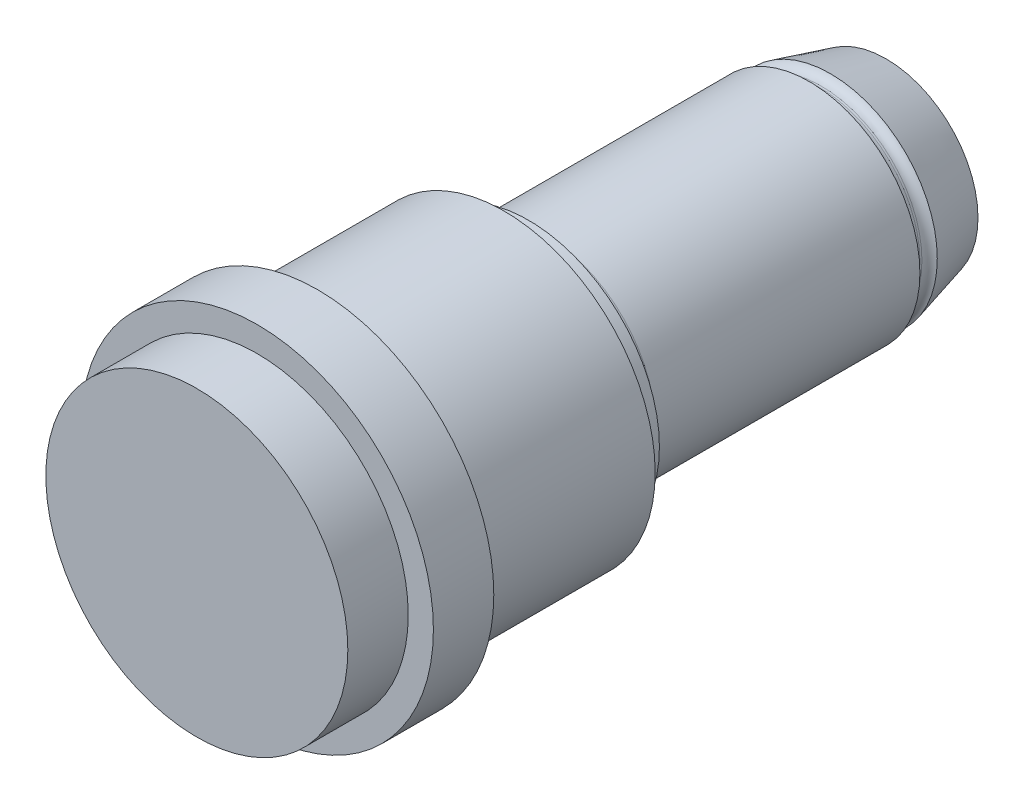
ISO-10303-21;
HEADER;
FILE_DESCRIPTION(('STEP AP214'),'2;1');
FILE_NAME('part.step','',(''),(''),'','','');
FILE_SCHEMA(('AUTOMOTIVE_DESIGN { 1 0 10303 214 1 1 1 1 }'));
ENDSEC;
DATA;
#1=APPLICATION_CONTEXT('core data for automotive mechanical design processes');
#2=APPLICATION_PROTOCOL_DEFINITION('international standard','automotive_design',2000,#1);
#3=PRODUCT_CONTEXT('',#1,'mechanical');
#4=PRODUCT('Part','Part','',(#3));
#5=PRODUCT_RELATED_PRODUCT_CATEGORY('part','',(#4));
#6=PRODUCT_DEFINITION_FORMATION('','',#4);
#7=PRODUCT_DEFINITION_CONTEXT('part definition',#1,'design');
#8=PRODUCT_DEFINITION('design','',#6,#7);
#9=PRODUCT_DEFINITION_SHAPE('','',#8);
#10=(LENGTH_UNIT() NAMED_UNIT(*) SI_UNIT(.MILLI.,.METRE.));
#11=(NAMED_UNIT(*) PLANE_ANGLE_UNIT() SI_UNIT($,.RADIAN.));
#12=(NAMED_UNIT(*) SI_UNIT($,.STERADIAN.) SOLID_ANGLE_UNIT());
#13=UNCERTAINTY_MEASURE_WITH_UNIT(LENGTH_MEASURE(1.E-05),#10,'distance_accuracy_value','');
#14=(GEOMETRIC_REPRESENTATION_CONTEXT(3) GLOBAL_UNCERTAINTY_ASSIGNED_CONTEXT((#13)) GLOBAL_UNIT_ASSIGNED_CONTEXT((#10,
#11,#12)) REPRESENTATION_CONTEXT('',''));
#15=CARTESIAN_POINT('',(0.,0.,0.));
#16=DIRECTION('',(0.,0.,1.));
#17=DIRECTION('',(1.,0.,0.));
#18=AXIS2_PLACEMENT_3D('',#15,#16,#17);
#19=CARTESIAN_POINT('',(170.,124.,-20.33));
#20=DIRECTION('',(0.,0.,1.));
#21=DIRECTION('',(1.,0.,0.));
#22=AXIS2_PLACEMENT_3D('',#19,#20,#21);
#23=TOROIDAL_SURFACE('',#22,11.,1.);
#24=CARTESIAN_POINT('',(170.,124.,-20.33));
#25=DIRECTION('',(0.,0.,1.));
#26=DIRECTION('',(1.,0.,0.));
#27=AXIS2_PLACEMENT_3D('',#24,#25,#26);
#28=CIRCLE('',#27,10.);
#29=CARTESIAN_POINT('',(180.,124.,-20.33));
#30=VERTEX_POINT('',#29);
#31=EDGE_CURVE('E50',#30,#30,#28,.T.);
#32=ORIENTED_EDGE('',*,*,#31,.F.);
#33=EDGE_LOOP('',(#32));
#34=FACE_BOUND('',#33,.T.);
#35=CARTESIAN_POINT('',(170.,124.,-21.2487202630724));
#36=DIRECTION('',(0.,0.,1.));
#37=DIRECTION('',(1.,0.,0.));
#38=AXIS2_PLACEMENT_3D('',#35,#36,#37);
#39=CIRCLE('',#38,10.6050910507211);
#40=CARTESIAN_POINT('',(180.605091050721,124.,-21.2487202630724));
#41=VERTEX_POINT('',#40);
#42=EDGE_CURVE('E10',#41,#41,#39,.T.);
#43=ORIENTED_EDGE('',*,*,#42,.T.);
#44=EDGE_LOOP('',(#43));
#45=FACE_BOUND('',#44,.T.);
#46=ADVANCED_FACE('F14',(#34,#45),#23,.F.);
#47=CARTESIAN_POINT('',(170.,124.,41.7));
#48=DIRECTION('',(0.,0.,-1.));
#49=DIRECTION('',(-1.,0.,0.));
#50=AXIS2_PLACEMENT_3D('',#47,#48,#49);
#51=CYLINDRICAL_SURFACE('',#50,15.);
#52=CARTESIAN_POINT('',(170.,124.,41.7));
#53=DIRECTION('',(0.,0.,1.));
#54=DIRECTION('',(1.,0.,0.));
#55=AXIS2_PLACEMENT_3D('',#52,#53,#54);
#56=CIRCLE('',#55,15.);
#57=CARTESIAN_POINT('',(185.,124.,41.7));
#58=VERTEX_POINT('',#57);
#59=EDGE_CURVE('E25',#58,#58,#56,.T.);
#60=ORIENTED_EDGE('',*,*,#59,.F.);
#61=EDGE_LOOP('',(#60));
#62=FACE_BOUND('',#61,.T.);
#63=CARTESIAN_POINT('',(170.,124.,35.7));
#64=DIRECTION('',(0.,0.,1.));
#65=DIRECTION('',(1.,0.,0.));
#66=AXIS2_PLACEMENT_3D('',#63,#64,#65);
#67=CIRCLE('',#66,15.);
#68=CARTESIAN_POINT('',(185.,124.,35.7));
#69=VERTEX_POINT('',#68);
#70=EDGE_CURVE('E30',#69,#69,#67,.T.);
#71=ORIENTED_EDGE('',*,*,#70,.T.);
#72=EDGE_LOOP('',(#71));
#73=FACE_BOUND('',#72,.T.);
#74=ADVANCED_FACE('F67',(#62,#73),#51,.T.);
#75=CARTESIAN_POINT('',(170.,124.,41.7));
#76=DIRECTION('',(0.,0.,1.));
#77=DIRECTION('',(1.,0.,0.));
#78=AXIS2_PLACEMENT_3D('',#75,#76,#77);
#79=PLANE('',#78);
#80=ORIENTED_EDGE('',*,*,#59,.T.);
#81=EDGE_LOOP('',(#80));
#82=FACE_BOUND('',#81,.T.);
#83=ADVANCED_FACE('F73',(#82),#79,.T.);
#84=CARTESIAN_POINT('',(170.,124.,35.7));
#85=DIRECTION('',(0.,0.,1.));
#86=DIRECTION('',(1.,0.,0.));
#87=AXIS2_PLACEMENT_3D('',#84,#85,#86);
#88=PLANE('',#87);
#89=CARTESIAN_POINT('',(170.,124.,35.7));
#90=DIRECTION('',(0.,0.,1.));
#91=DIRECTION('',(1.,0.,0.));
#92=AXIS2_PLACEMENT_3D('',#89,#90,#91);
#93=CIRCLE('',#92,17.5);
#94=CARTESIAN_POINT('',(187.5,124.,35.7));
#95=VERTEX_POINT('',#94);
#96=EDGE_CURVE('E115',#95,#95,#93,.T.);
#97=ORIENTED_EDGE('',*,*,#96,.T.);
#98=EDGE_LOOP('',(#97));
#99=FACE_BOUND('',#98,.T.);
#100=ORIENTED_EDGE('',*,*,#70,.F.);
#101=EDGE_LOOP('',(#100));
#102=FACE_BOUND('',#101,.T.);
#103=ADVANCED_FACE('F134',(#99,#102),#88,.T.);
#104=CARTESIAN_POINT('',(170.,124.,35.7));
#105=DIRECTION('',(0.,0.,-1.));
#106=DIRECTION('',(-1.,0.,0.));
#107=AXIS2_PLACEMENT_3D('',#104,#105,#106);
#108=CYLINDRICAL_SURFACE('',#107,17.5);
#109=ORIENTED_EDGE('',*,*,#96,.F.);
#110=EDGE_LOOP('',(#109));
#111=FACE_BOUND('',#110,.T.);
#112=CARTESIAN_POINT('',(170.,124.,29.7));
#113=DIRECTION('',(0.,0.,1.));
#114=DIRECTION('',(1.,0.,0.));
#115=AXIS2_PLACEMENT_3D('',#112,#113,#114);
#116=CIRCLE('',#115,17.5);
#117=CARTESIAN_POINT('',(187.5,124.,29.7));
#118=VERTEX_POINT('',#117);
#119=EDGE_CURVE('E53',#118,#118,#116,.T.);
#120=ORIENTED_EDGE('',*,*,#119,.T.);
#121=EDGE_LOOP('',(#120));
#122=FACE_BOUND('',#121,.T.);
#123=ADVANCED_FACE('F137',(#111,#122),#108,.T.);
#124=CARTESIAN_POINT('',(170.,124.,29.7));
#125=DIRECTION('',(0.,0.,1.));
#126=DIRECTION('',(1.,0.,0.));
#127=AXIS2_PLACEMENT_3D('',#124,#125,#126);
#128=PLANE('',#127);
#129=CARTESIAN_POINT('',(170.,124.,29.7));
#130=DIRECTION('',(0.,0.,1.));
#131=DIRECTION('',(1.,0.,0.));
#132=AXIS2_PLACEMENT_3D('',#129,#130,#131);
#133=CIRCLE('',#132,15.);
#134=CARTESIAN_POINT('',(185.,124.,29.7));
#135=VERTEX_POINT('',#134);
#136=EDGE_CURVE('E39',#135,#135,#133,.T.);
#137=ORIENTED_EDGE('',*,*,#136,.T.);
#138=EDGE_LOOP('',(#137));
#139=FACE_BOUND('',#138,.T.);
#140=ORIENTED_EDGE('',*,*,#119,.F.);
#141=EDGE_LOOP('',(#140));
#142=FACE_BOUND('',#141,.T.);
#143=ADVANCED_FACE('F103',(#139,#142),#128,.F.);
#144=CARTESIAN_POINT('',(170.,124.,-0.299999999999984));
#145=DIRECTION('',(0.,0.,1.));
#146=DIRECTION('',(1.,0.,0.));
#147=AXIS2_PLACEMENT_3D('',#144,#145,#146);
#148=CYLINDRICAL_SURFACE('',#147,15.);
#149=CARTESIAN_POINT('',(170.,124.,11.17));
#150=DIRECTION('',(0.,0.,1.));
#151=DIRECTION('',(1.,0.,0.));
#152=AXIS2_PLACEMENT_3D('',#149,#150,#151);
#153=CIRCLE('',#152,15.);
#154=CARTESIAN_POINT('',(185.,124.,11.17));
#155=VERTEX_POINT('',#154);
#156=EDGE_CURVE('E51',#155,#155,#153,.T.);
#157=ORIENTED_EDGE('',*,*,#156,.T.);
#158=EDGE_LOOP('',(#157));
#159=FACE_BOUND('',#158,.T.);
#160=ORIENTED_EDGE('',*,*,#136,.F.);
#161=EDGE_LOOP('',(#160));
#162=FACE_BOUND('',#161,.T.);
#163=ADVANCED_FACE('F98',(#159,#162),#148,.T.);
#164=CARTESIAN_POINT('',(170.,124.,11.17));
#165=DIRECTION('',(0.,0.,1.));
#166=DIRECTION('',(1.,0.,0.));
#167=AXIS2_PLACEMENT_3D('',#164,#165,#166);
#168=PLANE('',#167);
#169=CARTESIAN_POINT('',(170.,124.,11.17));
#170=DIRECTION('',(0.,0.,1.));
#171=DIRECTION('',(1.,0.,0.));
#172=AXIS2_PLACEMENT_3D('',#169,#170,#171);
#173=CIRCLE('',#172,13.);
#174=CARTESIAN_POINT('',(183.,124.,11.17));
#175=VERTEX_POINT('',#174);
#176=EDGE_CURVE('E43',#175,#175,#173,.T.);
#177=ORIENTED_EDGE('',*,*,#176,.T.);
#178=EDGE_LOOP('',(#177));
#179=FACE_BOUND('',#178,.T.);
#180=ORIENTED_EDGE('',*,*,#156,.F.);
#181=EDGE_LOOP('',(#180));
#182=FACE_BOUND('',#181,.T.);
#183=ADVANCED_FACE('F95',(#179,#182),#168,.F.);
#184=CARTESIAN_POINT('',(170.,124.,8.17));
#185=DIRECTION('',(0.,0.,1.));
#186=DIRECTION('',(1.,0.,0.));
#187=AXIS2_PLACEMENT_3D('',#184,#185,#186);
#188=CYLINDRICAL_SURFACE('',#187,13.);
#189=CARTESIAN_POINT('',(170.,124.,8.74735026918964));
#190=DIRECTION('',(0.,0.,1.));
#191=DIRECTION('',(1.,0.,0.));
#192=AXIS2_PLACEMENT_3D('',#189,#190,#191);
#193=CIRCLE('',#192,13.);
#194=CARTESIAN_POINT('',(183.,124.,8.74735026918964));
#195=VERTEX_POINT('',#194);
#196=EDGE_CURVE('E40',#195,#195,#193,.T.);
#197=ORIENTED_EDGE('',*,*,#196,.T.);
#198=EDGE_LOOP('',(#197));
#199=FACE_BOUND('',#198,.T.);
#200=ORIENTED_EDGE('',*,*,#176,.F.);
#201=EDGE_LOOP('',(#200));
#202=FACE_BOUND('',#201,.T.);
#203=ADVANCED_FACE('F91',(#199,#202),#188,.T.);
#204=CARTESIAN_POINT('',(170.,124.,8.74735026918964));
#205=DIRECTION('',(0.,0.,1.));
#206=DIRECTION('',(1.,0.,0.));
#207=AXIS2_PLACEMENT_3D('',#204,#205,#206);
#208=CONICAL_SURFACE('',#207,13.,1.0471975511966);
#209=CARTESIAN_POINT('',(170.,124.,8.17));
#210=DIRECTION('',(0.,0.,1.));
#211=DIRECTION('',(1.,0.,0.));
#212=AXIS2_PLACEMENT_3D('',#209,#210,#211);
#213=CIRCLE('',#212,12.);
#214=CARTESIAN_POINT('',(182.,124.,8.17));
#215=VERTEX_POINT('',#214);
#216=EDGE_CURVE('E36',#215,#215,#213,.F.);
#217=ORIENTED_EDGE('',*,*,#216,.F.);
#218=EDGE_LOOP('',(#217));
#219=FACE_BOUND('',#218,.T.);
#220=ORIENTED_EDGE('',*,*,#196,.F.);
#221=EDGE_LOOP('',(#220));
#222=FACE_BOUND('',#221,.T.);
#223=ADVANCED_FACE('F88',(#219,#222),#208,.T.);
#224=CARTESIAN_POINT('',(170.,124.,-43.83));
#225=DIRECTION('',(0.,0.,1.));
#226=DIRECTION('',(1.,0.,0.));
#227=AXIS2_PLACEMENT_3D('',#224,#225,#226);
#228=CYLINDRICAL_SURFACE('',#227,11.);
#229=CARTESIAN_POINT('',(170.,124.,-19.13));
#230=DIRECTION('',(0.,0.,1.));
#231=DIRECTION('',(1.,0.,0.));
#232=AXIS2_PLACEMENT_3D('',#229,#230,#231);
#233=CIRCLE('',#232,11.);
#234=CARTESIAN_POINT('',(181.,124.,-19.13));
#235=VERTEX_POINT('',#234);
#236=EDGE_CURVE('E34',#235,#235,#233,.T.);
#237=ORIENTED_EDGE('',*,*,#236,.T.);
#238=EDGE_LOOP('',(#237));
#239=FACE_BOUND('',#238,.T.);
#240=CARTESIAN_POINT('',(170.,124.,7.17));
#241=DIRECTION('',(0.,0.,1.));
#242=DIRECTION('',(1.,0.,0.));
#243=AXIS2_PLACEMENT_3D('',#240,#241,#242);
#244=CIRCLE('',#243,11.);
#245=CARTESIAN_POINT('',(181.,124.,7.17));
#246=VERTEX_POINT('',#245);
#247=EDGE_CURVE('E21',#246,#246,#244,.F.);
#248=ORIENTED_EDGE('',*,*,#247,.T.);
#249=EDGE_LOOP('',(#248));
#250=FACE_BOUND('',#249,.T.);
#251=ADVANCED_FACE('F79',(#239,#250),#228,.T.);
#252=CARTESIAN_POINT('',(170.,124.,7.17));
#253=DIRECTION('',(0.,0.,1.));
#254=DIRECTION('',(1.,0.,0.));
#255=AXIS2_PLACEMENT_3D('',#252,#253,#254);
#256=TOROIDAL_SURFACE('',#255,12.,1.);
#257=ORIENTED_EDGE('',*,*,#216,.T.);
#258=EDGE_LOOP('',(#257));
#259=FACE_BOUND('',#258,.T.);
#260=ORIENTED_EDGE('',*,*,#247,.F.);
#261=EDGE_LOOP('',(#260));
#262=FACE_BOUND('',#261,.T.);
#263=ADVANCED_FACE('F84',(#259,#262),#256,.F.);
#264=CARTESIAN_POINT('',(170.,124.,-31.7));
#265=DIRECTION('',(0.,0.,1.));
#266=DIRECTION('',(1.,0.,0.));
#267=AXIS2_PLACEMENT_3D('',#264,#265,#266);
#268=CYLINDRICAL_SURFACE('',#267,10.);
#269=CARTESIAN_POINT('',(170.,124.,-20.13));
#270=DIRECTION('',(0.,0.,1.));
#271=DIRECTION('',(1.,0.,0.));
#272=AXIS2_PLACEMENT_3D('',#269,#270,#271);
#273=CIRCLE('',#272,10.);
#274=CARTESIAN_POINT('',(180.,124.,-20.13));
#275=VERTEX_POINT('',#274);
#276=EDGE_CURVE('E47',#275,#275,#273,.T.);
#277=ORIENTED_EDGE('',*,*,#276,.F.);
#278=EDGE_LOOP('',(#277));
#279=FACE_BOUND('',#278,.T.);
#280=ORIENTED_EDGE('',*,*,#31,.T.);
#281=EDGE_LOOP('',(#280));
#282=FACE_BOUND('',#281,.T.);
#283=ADVANCED_FACE('F82',(#279,#282),#268,.T.);
#284=CARTESIAN_POINT('',(170.,124.,-20.13));
#285=DIRECTION('',(0.,0.,1.));
#286=DIRECTION('',(1.,0.,0.));
#287=AXIS2_PLACEMENT_3D('',#284,#285,#286);
#288=TOROIDAL_SURFACE('',#287,11.,1.);
#289=ORIENTED_EDGE('',*,*,#236,.F.);
#290=EDGE_LOOP('',(#289));
#291=FACE_BOUND('',#290,.T.);
#292=ORIENTED_EDGE('',*,*,#276,.T.);
#293=EDGE_LOOP('',(#292));
#294=FACE_BOUND('',#293,.T.);
#295=ADVANCED_FACE('F65',(#291,#294),#288,.F.);
#296=CARTESIAN_POINT('',(170.,124.,-26.7749));
#297=DIRECTION('',(0.,0.,-1.));
#298=DIRECTION('',(-1.,0.,0.));
#299=AXIS2_PLACEMENT_3D('',#296,#297,#298);
#300=PLANE('',#299);
#301=CARTESIAN_POINT('',(170.,124.,-26.7749));
#302=DIRECTION('',(0.,0.,-1.));
#303=DIRECTION('',(-1.,0.,0.));
#304=AXIS2_PLACEMENT_3D('',#301,#302,#303);
#305=CIRCLE('',#304,9.12435565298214);
#306=CARTESIAN_POINT('',(160.875644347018,124.,-26.7749));
#307=VERTEX_POINT('',#306);
#308=EDGE_CURVE('E46',#307,#307,#305,.T.);
#309=ORIENTED_EDGE('',*,*,#308,.T.);
#310=EDGE_LOOP('',(#309));
#311=FACE_BOUND('',#310,.T.);
#312=ADVANCED_FACE('F57',(#311),#300,.T.);
#313=CARTESIAN_POINT('',(170.,124.,-26.7749));
#314=DIRECTION('',(0.,0.,1.));
#315=DIRECTION('',(1.,0.,0.));
#316=AXIS2_PLACEMENT_3D('',#313,#314,#315);
#317=CONICAL_SURFACE('',#316,9.12435565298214,0.26179938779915);
#318=ORIENTED_EDGE('',*,*,#42,.F.);
#319=EDGE_LOOP('',(#318));
#320=FACE_BOUND('',#319,.T.);
#321=ORIENTED_EDGE('',*,*,#308,.F.);
#322=EDGE_LOOP('',(#321));
#323=FACE_BOUND('',#322,.T.);
#324=ADVANCED_FACE('F16',(#320,#323),#317,.T.);
#325=CLOSED_SHELL('',(#46,#74,#83,#103,#123,#143,#163,#183,#203,#223,#251,#263,#283,#295,#312,#324));
#326=MANIFOLD_SOLID_BREP('B1',#325);
#327=ADVANCED_BREP_SHAPE_REPRESENTATION('',(#18,#326),#14);
#328=SHAPE_DEFINITION_REPRESENTATION(#9,#327);
ENDSEC;
END-ISO-10303-21;
